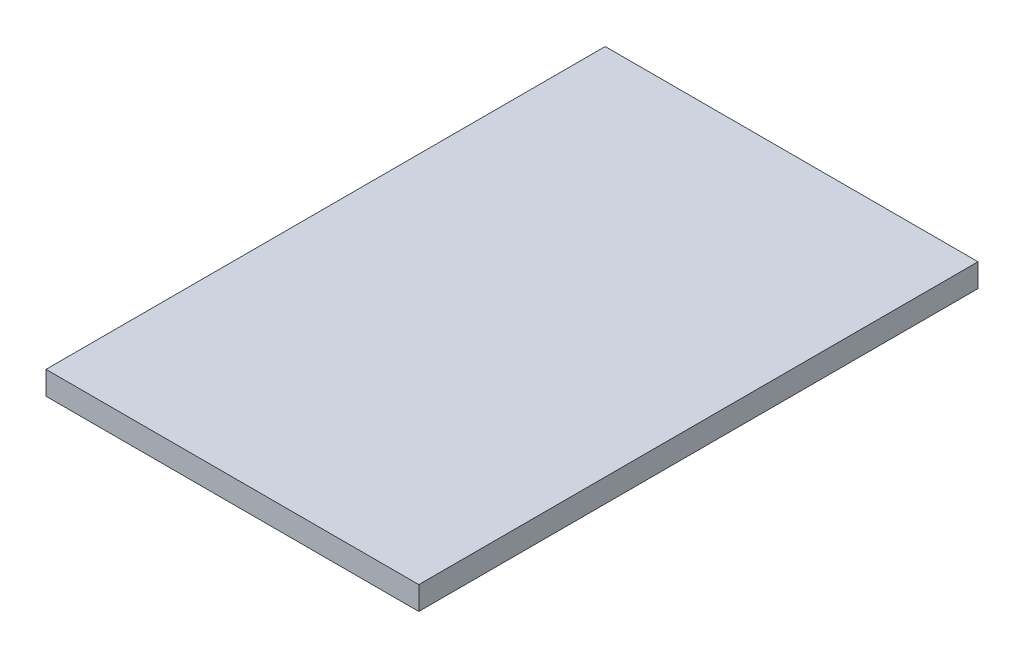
from build123d import *

# Parameters (mm, degrees)
SKETCH1_W           = 50.8
SKETCH1_H           = 76.2
BOSS_EXTRUDE1_DEPTH = 3.175


with BuildPart() as part:
    # Sketch1 → Boss-Extrude1 (new body)
    with BuildSketch(Plane(origin=(0, 0, 0), x_dir=(1, 0, 0), z_dir=(0, 1, 0))):
        Rectangle(SKETCH1_W, SKETCH1_H)
    extrude(amount=BOSS_EXTRUDE1_DEPTH)


solid = part.part
